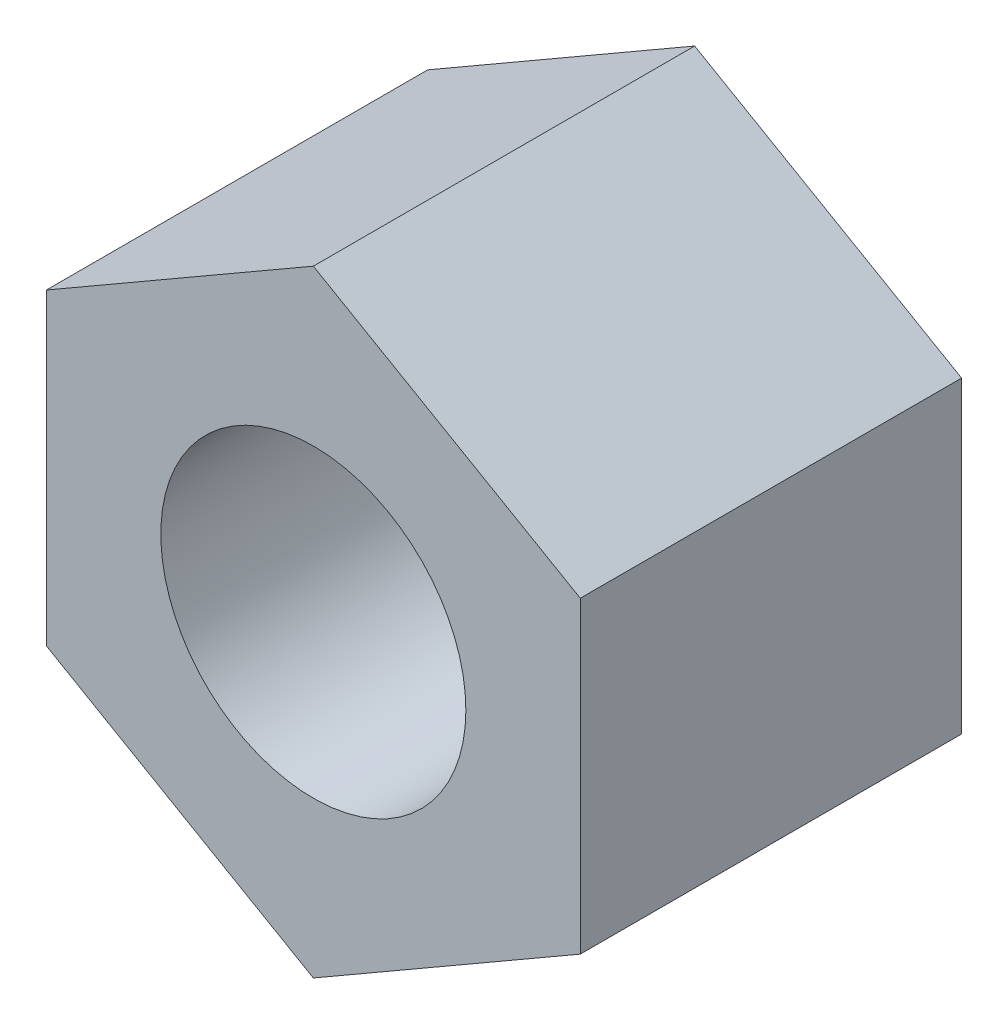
ISO-10303-21;
HEADER;
FILE_DESCRIPTION(('STEP AP214'),'2;1');
FILE_NAME('part.step','',(''),(''),'','','');
FILE_SCHEMA(('AUTOMOTIVE_DESIGN { 1 0 10303 214 1 1 1 1 }'));
ENDSEC;
DATA;
#1=APPLICATION_CONTEXT('core data for automotive mechanical design processes');
#2=APPLICATION_PROTOCOL_DEFINITION('international standard','automotive_design',2000,#1);
#3=PRODUCT_CONTEXT('',#1,'mechanical');
#4=PRODUCT('Part','Part','',(#3));
#5=PRODUCT_RELATED_PRODUCT_CATEGORY('part','',(#4));
#6=PRODUCT_DEFINITION_FORMATION('','',#4);
#7=PRODUCT_DEFINITION_CONTEXT('part definition',#1,'design');
#8=PRODUCT_DEFINITION('design','',#6,#7);
#9=PRODUCT_DEFINITION_SHAPE('','',#8);
#10=(LENGTH_UNIT() NAMED_UNIT(*) SI_UNIT(.MILLI.,.METRE.));
#11=(NAMED_UNIT(*) PLANE_ANGLE_UNIT() SI_UNIT($,.RADIAN.));
#12=(NAMED_UNIT(*) SI_UNIT($,.STERADIAN.) SOLID_ANGLE_UNIT());
#13=UNCERTAINTY_MEASURE_WITH_UNIT(LENGTH_MEASURE(1.E-05),#10,'distance_accuracy_value','');
#14=(GEOMETRIC_REPRESENTATION_CONTEXT(3) GLOBAL_UNCERTAINTY_ASSIGNED_CONTEXT((#13)) GLOBAL_UNIT_ASSIGNED_CONTEXT((#10,
#11,#12)) REPRESENTATION_CONTEXT('',''));
#15=CARTESIAN_POINT('',(0.,0.,0.));
#16=DIRECTION('',(0.,0.,1.));
#17=DIRECTION('',(1.,0.,0.));
#18=AXIS2_PLACEMENT_3D('',#15,#16,#17);
#19=CARTESIAN_POINT('',(0.,0.,5.));
#20=DIRECTION('',(0.,0.,1.));
#21=DIRECTION('',(1.,0.,0.));
#22=AXIS2_PLACEMENT_3D('',#19,#20,#21);
#23=PLANE('',#22);
#24=DIRECTION('',(0.,1.,0.));
#25=VECTOR('',#24,1.);
#26=CARTESIAN_POINT('',(3.5,-2.02072594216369,5.));
#27=LINE('',#26,#25);
#28=CARTESIAN_POINT('',(3.5,-2.02072594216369,5.));
#29=VERTEX_POINT('',#28);
#30=CARTESIAN_POINT('',(3.5,2.02072594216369,5.));
#31=VERTEX_POINT('',#30);
#32=EDGE_CURVE('E139',#29,#31,#27,.T.);
#33=ORIENTED_EDGE('',*,*,#32,.T.);
#34=DIRECTION('',(-0.866025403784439,0.5,0.));
#35=VECTOR('',#34,1.);
#36=CARTESIAN_POINT('',(3.5,2.02072594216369,5.));
#37=LINE('',#36,#35);
#38=CARTESIAN_POINT('',(0.,4.04145188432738,5.));
#39=VERTEX_POINT('',#38);
#40=EDGE_CURVE('E97',#31,#39,#37,.T.);
#41=ORIENTED_EDGE('',*,*,#40,.T.);
#42=DIRECTION('',(-0.866025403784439,-0.5,0.));
#43=VECTOR('',#42,1.);
#44=CARTESIAN_POINT('',(0.,4.04145188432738,5.));
#45=LINE('',#44,#43);
#46=CARTESIAN_POINT('',(-3.5,2.02072594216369,5.));
#47=VERTEX_POINT('',#46);
#48=EDGE_CURVE('E110',#39,#47,#45,.T.);
#49=ORIENTED_EDGE('',*,*,#48,.T.);
#50=DIRECTION('',(0.,-1.,0.));
#51=VECTOR('',#50,1.);
#52=CARTESIAN_POINT('',(-3.5,2.02072594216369,5.));
#53=LINE('',#52,#51);
#54=CARTESIAN_POINT('',(-3.5,-2.02072594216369,5.));
#55=VERTEX_POINT('',#54);
#56=EDGE_CURVE('E104',#47,#55,#53,.T.);
#57=ORIENTED_EDGE('',*,*,#56,.T.);
#58=DIRECTION('',(0.866025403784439,-0.5,0.));
#59=VECTOR('',#58,1.);
#60=CARTESIAN_POINT('',(-3.5,-2.02072594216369,5.));
#61=LINE('',#60,#59);
#62=CARTESIAN_POINT('',(0.,-4.04145188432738,5.));
#63=VERTEX_POINT('',#62);
#64=EDGE_CURVE('E108',#55,#63,#61,.T.);
#65=ORIENTED_EDGE('',*,*,#64,.T.);
#66=DIRECTION('',(0.866025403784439,0.5,0.));
#67=VECTOR('',#66,1.);
#68=CARTESIAN_POINT('',(0.,-4.04145188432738,5.));
#69=LINE('',#68,#67);
#70=EDGE_CURVE('E60',#63,#29,#69,.T.);
#71=ORIENTED_EDGE('',*,*,#70,.T.);
#72=EDGE_LOOP('',(#33,#41,#49,#57,#65,#71));
#73=FACE_BOUND('',#72,.T.);
#74=CARTESIAN_POINT('',(0.,0.,5.));
#75=DIRECTION('',(0.,0.,1.));
#76=DIRECTION('',(1.,0.,0.));
#77=AXIS2_PLACEMENT_3D('',#74,#75,#76);
#78=CIRCLE('',#77,2.);
#79=CARTESIAN_POINT('',(2.,0.,5.));
#80=VERTEX_POINT('',#79);
#81=EDGE_CURVE('E132',#80,#80,#78,.T.);
#82=ORIENTED_EDGE('',*,*,#81,.F.);
#83=EDGE_LOOP('',(#82));
#84=FACE_BOUND('',#83,.T.);
#85=ADVANCED_FACE('F43',(#73,#84),#23,.T.);
#86=CARTESIAN_POINT('',(0.,0.,0.));
#87=DIRECTION('',(0.,0.,1.));
#88=DIRECTION('',(1.,0.,0.));
#89=AXIS2_PLACEMENT_3D('',#86,#87,#88);
#90=PLANE('',#89);
#91=DIRECTION('',(0.,1.,0.));
#92=VECTOR('',#91,1.);
#93=CARTESIAN_POINT('',(3.5,-2.02072594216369,0.));
#94=LINE('',#93,#92);
#95=CARTESIAN_POINT('',(3.5,-2.02072594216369,0.));
#96=VERTEX_POINT('',#95);
#97=CARTESIAN_POINT('',(3.5,2.02072594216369,0.));
#98=VERTEX_POINT('',#97);
#99=EDGE_CURVE('E128',#96,#98,#94,.T.);
#100=ORIENTED_EDGE('',*,*,#99,.F.);
#101=DIRECTION('',(0.866025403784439,0.5,0.));
#102=VECTOR('',#101,1.);
#103=CARTESIAN_POINT('',(0.,-4.04145188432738,0.));
#104=LINE('',#103,#102);
#105=CARTESIAN_POINT('',(0.,-4.04145188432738,0.));
#106=VERTEX_POINT('',#105);
#107=EDGE_CURVE('E89',#106,#96,#104,.T.);
#108=ORIENTED_EDGE('',*,*,#107,.F.);
#109=DIRECTION('',(0.866025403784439,-0.5,0.));
#110=VECTOR('',#109,1.);
#111=CARTESIAN_POINT('',(-3.5,-2.02072594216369,0.));
#112=LINE('',#111,#110);
#113=CARTESIAN_POINT('',(-3.5,-2.02072594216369,0.));
#114=VERTEX_POINT('',#113);
#115=EDGE_CURVE('E83',#114,#106,#112,.T.);
#116=ORIENTED_EDGE('',*,*,#115,.F.);
#117=DIRECTION('',(0.,-1.,0.));
#118=VECTOR('',#117,1.);
#119=CARTESIAN_POINT('',(-3.5,2.02072594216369,0.));
#120=LINE('',#119,#118);
#121=CARTESIAN_POINT('',(-3.5,2.02072594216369,0.));
#122=VERTEX_POINT('',#121);
#123=EDGE_CURVE('E118',#122,#114,#120,.T.);
#124=ORIENTED_EDGE('',*,*,#123,.F.);
#125=DIRECTION('',(-0.866025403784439,-0.5,0.));
#126=VECTOR('',#125,1.);
#127=CARTESIAN_POINT('',(0.,4.04145188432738,0.));
#128=LINE('',#127,#126);
#129=CARTESIAN_POINT('',(0.,4.04145188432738,0.));
#130=VERTEX_POINT('',#129);
#131=EDGE_CURVE('E134',#130,#122,#128,.T.);
#132=ORIENTED_EDGE('',*,*,#131,.F.);
#133=DIRECTION('',(-0.866025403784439,0.5,0.));
#134=VECTOR('',#133,1.);
#135=CARTESIAN_POINT('',(3.5,2.02072594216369,0.));
#136=LINE('',#135,#134);
#137=EDGE_CURVE('E131',#98,#130,#136,.T.);
#138=ORIENTED_EDGE('',*,*,#137,.F.);
#139=EDGE_LOOP('',(#100,#108,#116,#124,#132,#138));
#140=FACE_BOUND('',#139,.T.);
#141=CARTESIAN_POINT('',(0.,0.,0.));
#142=DIRECTION('',(0.,0.,1.));
#143=DIRECTION('',(1.,0.,0.));
#144=AXIS2_PLACEMENT_3D('',#141,#142,#143);
#145=CIRCLE('',#144,2.);
#146=CARTESIAN_POINT('',(2.,0.,0.));
#147=VERTEX_POINT('',#146);
#148=EDGE_CURVE('E232',#147,#147,#145,.T.);
#149=ORIENTED_EDGE('',*,*,#148,.T.);
#150=EDGE_LOOP('',(#149));
#151=FACE_BOUND('',#150,.T.);
#152=ADVANCED_FACE('F148',(#140,#151),#90,.F.);
#153=CARTESIAN_POINT('',(3.5,-2.02072594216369,5.));
#154=DIRECTION('',(-1.,0.,0.));
#155=DIRECTION('',(0.,-1.,0.));
#156=AXIS2_PLACEMENT_3D('',#153,#154,#155);
#157=PLANE('',#156);
#158=ORIENTED_EDGE('',*,*,#99,.T.);
#159=DIRECTION('',(0.,0.,-1.));
#160=VECTOR('',#159,1.);
#161=CARTESIAN_POINT('',(3.5,2.02072594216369,5.));
#162=LINE('',#161,#160);
#163=EDGE_CURVE('E11',#31,#98,#162,.T.);
#164=ORIENTED_EDGE('',*,*,#163,.F.);
#165=ORIENTED_EDGE('',*,*,#32,.F.);
#166=DIRECTION('',(0.,0.,-1.));
#167=VECTOR('',#166,1.);
#168=CARTESIAN_POINT('',(3.5,-2.02072594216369,5.));
#169=LINE('',#168,#167);
#170=EDGE_CURVE('E124',#29,#96,#169,.T.);
#171=ORIENTED_EDGE('',*,*,#170,.T.);
#172=EDGE_LOOP('',(#158,#164,#165,#171));
#173=FACE_BOUND('',#172,.T.);
#174=ADVANCED_FACE('F45',(#173),#157,.F.);
#175=CARTESIAN_POINT('',(3.5,2.02072594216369,5.));
#176=DIRECTION('',(-0.5,-0.866025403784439,0.));
#177=DIRECTION('',(0.866025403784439,-0.5,0.));
#178=AXIS2_PLACEMENT_3D('',#175,#176,#177);
#179=PLANE('',#178);
#180=ORIENTED_EDGE('',*,*,#137,.T.);
#181=DIRECTION('',(0.,0.,-1.));
#182=VECTOR('',#181,1.);
#183=CARTESIAN_POINT('',(0.,4.04145188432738,5.));
#184=LINE('',#183,#182);
#185=EDGE_CURVE('E52',#39,#130,#184,.T.);
#186=ORIENTED_EDGE('',*,*,#185,.F.);
#187=ORIENTED_EDGE('',*,*,#40,.F.);
#188=ORIENTED_EDGE('',*,*,#163,.T.);
#189=EDGE_LOOP('',(#180,#186,#187,#188));
#190=FACE_BOUND('',#189,.T.);
#191=ADVANCED_FACE('F173',(#190),#179,.F.);
#192=CARTESIAN_POINT('',(0.,4.04145188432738,5.));
#193=DIRECTION('',(0.5,-0.866025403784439,0.));
#194=DIRECTION('',(0.866025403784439,0.5,0.));
#195=AXIS2_PLACEMENT_3D('',#192,#193,#194);
#196=PLANE('',#195);
#197=ORIENTED_EDGE('',*,*,#131,.T.);
#198=DIRECTION('',(0.,0.,-1.));
#199=VECTOR('',#198,1.);
#200=CARTESIAN_POINT('',(-3.5,2.02072594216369,5.));
#201=LINE('',#200,#199);
#202=EDGE_CURVE('E119',#47,#122,#201,.T.);
#203=ORIENTED_EDGE('',*,*,#202,.F.);
#204=ORIENTED_EDGE('',*,*,#48,.F.);
#205=ORIENTED_EDGE('',*,*,#185,.T.);
#206=EDGE_LOOP('',(#197,#203,#204,#205));
#207=FACE_BOUND('',#206,.T.);
#208=ADVANCED_FACE('F145',(#207),#196,.F.);
#209=CARTESIAN_POINT('',(-3.5,2.02072594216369,5.));
#210=DIRECTION('',(1.,0.,0.));
#211=DIRECTION('',(0.,1.,0.));
#212=AXIS2_PLACEMENT_3D('',#209,#210,#211);
#213=PLANE('',#212);
#214=ORIENTED_EDGE('',*,*,#123,.T.);
#215=DIRECTION('',(0.,0.,-1.));
#216=VECTOR('',#215,1.);
#217=CARTESIAN_POINT('',(-3.5,-2.02072594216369,5.));
#218=LINE('',#217,#216);
#219=EDGE_CURVE('E115',#55,#114,#218,.T.);
#220=ORIENTED_EDGE('',*,*,#219,.F.);
#221=ORIENTED_EDGE('',*,*,#56,.F.);
#222=ORIENTED_EDGE('',*,*,#202,.T.);
#223=EDGE_LOOP('',(#214,#220,#221,#222));
#224=FACE_BOUND('',#223,.T.);
#225=ADVANCED_FACE('F116',(#224),#213,.F.);
#226=CARTESIAN_POINT('',(-3.5,-2.02072594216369,5.));
#227=DIRECTION('',(0.5,0.866025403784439,0.));
#228=DIRECTION('',(-0.866025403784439,0.5,0.));
#229=AXIS2_PLACEMENT_3D('',#226,#227,#228);
#230=PLANE('',#229);
#231=ORIENTED_EDGE('',*,*,#115,.T.);
#232=DIRECTION('',(0.,0.,-1.));
#233=VECTOR('',#232,1.);
#234=CARTESIAN_POINT('',(0.,-4.04145188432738,5.));
#235=LINE('',#234,#233);
#236=EDGE_CURVE('E120',#63,#106,#235,.T.);
#237=ORIENTED_EDGE('',*,*,#236,.F.);
#238=ORIENTED_EDGE('',*,*,#64,.F.);
#239=ORIENTED_EDGE('',*,*,#219,.T.);
#240=EDGE_LOOP('',(#231,#237,#238,#239));
#241=FACE_BOUND('',#240,.T.);
#242=ADVANCED_FACE('F122',(#241),#230,.F.);
#243=CARTESIAN_POINT('',(0.,-4.04145188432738,5.));
#244=DIRECTION('',(-0.5,0.866025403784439,0.));
#245=DIRECTION('',(-0.866025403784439,-0.5,0.));
#246=AXIS2_PLACEMENT_3D('',#243,#244,#245);
#247=PLANE('',#246);
#248=ORIENTED_EDGE('',*,*,#107,.T.);
#249=ORIENTED_EDGE('',*,*,#170,.F.);
#250=ORIENTED_EDGE('',*,*,#70,.F.);
#251=ORIENTED_EDGE('',*,*,#236,.T.);
#252=EDGE_LOOP('',(#248,#249,#250,#251));
#253=FACE_BOUND('',#252,.T.);
#254=ADVANCED_FACE('F153',(#253),#247,.F.);
#255=CARTESIAN_POINT('',(0.,0.,5.));
#256=DIRECTION('',(0.,0.,-1.));
#257=DIRECTION('',(-1.,0.,0.));
#258=AXIS2_PLACEMENT_3D('',#255,#256,#257);
#259=CYLINDRICAL_SURFACE('',#258,2.);
#260=ORIENTED_EDGE('',*,*,#81,.T.);
#261=EDGE_LOOP('',(#260));
#262=FACE_BOUND('',#261,.T.);
#263=ORIENTED_EDGE('',*,*,#148,.F.);
#264=EDGE_LOOP('',(#263));
#265=FACE_BOUND('',#264,.T.);
#266=ADVANCED_FACE('F155',(#262,#265),#259,.F.);
#267=CLOSED_SHELL('',(#85,#152,#174,#191,#208,#225,#242,#254,#266));
#268=MANIFOLD_SOLID_BREP('B2',#267);
#269=ADVANCED_BREP_SHAPE_REPRESENTATION('',(#18,#268),#14);
#270=SHAPE_DEFINITION_REPRESENTATION(#9,#269);
ENDSEC;
END-ISO-10303-21;
